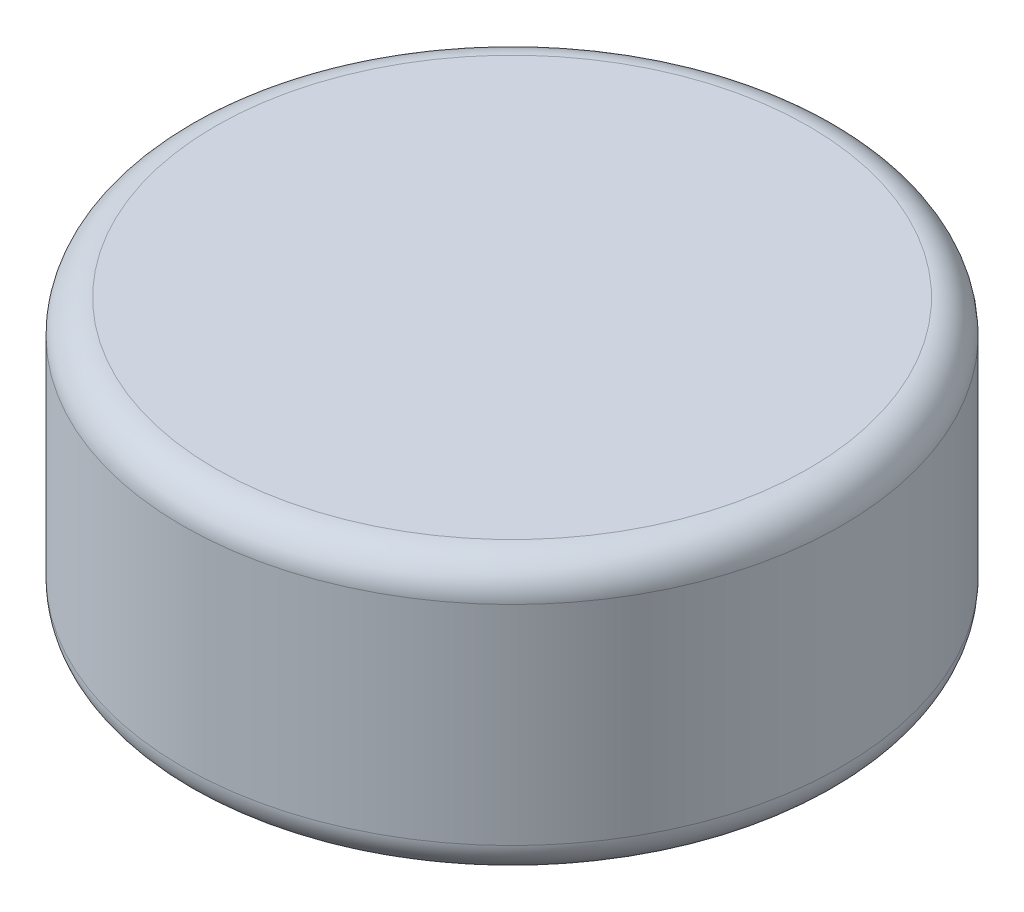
from build123d import *

# Parameters (mm, degrees)
SKETCH1_R           = 3
BOSS_EXTRUDE1_DEPTH = 2.5
FILLET1_R           = 0.3


with BuildPart() as part:
    # Sketch1 → Boss-Extrude1 (new body)
    with BuildSketch(Plane(origin=(0, 0, 0), x_dir=(1, 0, 0), z_dir=(0, 1, 0))):
        with Locations(Location((0, 0, 0), (0, 0, 270))):
            Circle(SKETCH1_R)
    extrude(amount=BOSS_EXTRUDE1_DEPTH)

    # Fillet1
    fillet1_edges = [part.edges().sort_by_distance(p)[0] for p in [
        (0, 0, -3),
        (0, 2.5, -3),
    ]]
    fillet(fillet1_edges, radius=FILLET1_R)


solid = part.part
